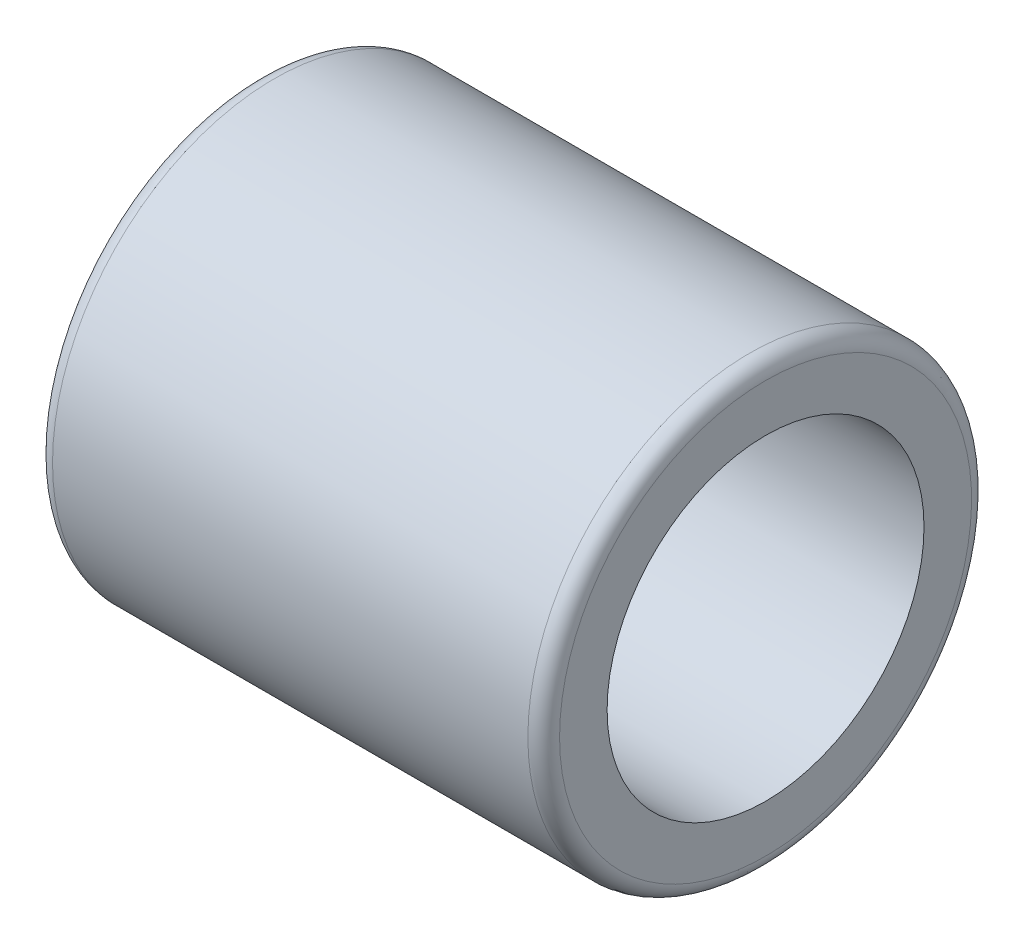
ISO-10303-21;
HEADER;
FILE_DESCRIPTION(('STEP AP214'),'2;1');
FILE_NAME('part.step','',(''),(''),'','','');
FILE_SCHEMA(('AUTOMOTIVE_DESIGN { 1 0 10303 214 1 1 1 1 }'));
ENDSEC;
DATA;
#1=APPLICATION_CONTEXT('core data for automotive mechanical design processes');
#2=APPLICATION_PROTOCOL_DEFINITION('international standard','automotive_design',2000,#1);
#3=PRODUCT_CONTEXT('',#1,'mechanical');
#4=PRODUCT('Part','Part','',(#3));
#5=PRODUCT_RELATED_PRODUCT_CATEGORY('part','',(#4));
#6=PRODUCT_DEFINITION_FORMATION('','',#4);
#7=PRODUCT_DEFINITION_CONTEXT('part definition',#1,'design');
#8=PRODUCT_DEFINITION('design','',#6,#7);
#9=PRODUCT_DEFINITION_SHAPE('','',#8);
#10=(LENGTH_UNIT() NAMED_UNIT(*) SI_UNIT(.MILLI.,.METRE.));
#11=(NAMED_UNIT(*) PLANE_ANGLE_UNIT() SI_UNIT($,.RADIAN.));
#12=(NAMED_UNIT(*) SI_UNIT($,.STERADIAN.) SOLID_ANGLE_UNIT());
#13=UNCERTAINTY_MEASURE_WITH_UNIT(LENGTH_MEASURE(1.E-05),#10,'distance_accuracy_value','');
#14=(GEOMETRIC_REPRESENTATION_CONTEXT(3) GLOBAL_UNCERTAINTY_ASSIGNED_CONTEXT((#13)) GLOBAL_UNIT_ASSIGNED_CONTEXT((#10,
#11,#12)) REPRESENTATION_CONTEXT('',''));
#15=CARTESIAN_POINT('',(0.,0.,0.));
#16=DIRECTION('',(0.,0.,1.));
#17=DIRECTION('',(1.,0.,0.));
#18=AXIS2_PLACEMENT_3D('',#15,#16,#17);
#19=CARTESIAN_POINT('',(0.,14.375,0.));
#20=DIRECTION('',(-1.,0.,0.));
#21=DIRECTION('',(0.,1.,0.));
#22=AXIS2_PLACEMENT_3D('',#19,#20,#21);
#23=PLANE('',#22);
#24=CARTESIAN_POINT('',(0.,0.,0.));
#25=DIRECTION('',(1.,0.,0.));
#26=DIRECTION('',(0.,1.,0.));
#27=AXIS2_PLACEMENT_3D('',#24,#25,#26);
#28=CIRCLE('',#27,12.5);
#29=CARTESIAN_POINT('',(0.,-12.5,0.));
#30=VERTEX_POINT('',#29);
#31=EDGE_CURVE('E103',#30,#30,#28,.T.);
#32=ORIENTED_EDGE('',*,*,#31,.T.);
#33=EDGE_LOOP('',(#32));
#34=FACE_BOUND('',#33,.T.);
#35=CARTESIAN_POINT('',(0.,0.,0.));
#36=DIRECTION('',(1.,0.,0.));
#37=DIRECTION('',(0.,1.,0.));
#38=AXIS2_PLACEMENT_3D('',#35,#36,#37);
#39=CIRCLE('',#38,16.25);
#40=CARTESIAN_POINT('',(0.,16.25,0.));
#41=VERTEX_POINT('',#40);
#42=CARTESIAN_POINT('',(0.,0.,16.25));
#43=VERTEX_POINT('',#42);
#44=EDGE_CURVE('E107',#41,#43,#39,.T.);
#45=ORIENTED_EDGE('',*,*,#44,.F.);
#46=CARTESIAN_POINT('',(0.,0.,0.));
#47=DIRECTION('',(1.,0.,0.));
#48=DIRECTION('',(0.,1.,0.));
#49=AXIS2_PLACEMENT_3D('',#46,#47,#48);
#50=CIRCLE('',#49,16.25);
#51=EDGE_CURVE('E97',#43,#41,#50,.T.);
#52=ORIENTED_EDGE('',*,*,#51,.F.);
#53=EDGE_LOOP('',(#45,#52));
#54=FACE_BOUND('',#53,.T.);
#55=ADVANCED_FACE('F16',(#34,#54),#23,.T.);
#56=CARTESIAN_POINT('',(40.,14.375,0.));
#57=DIRECTION('',(1.,0.,0.));
#58=DIRECTION('',(0.,1.,0.));
#59=AXIS2_PLACEMENT_3D('',#56,#57,#58);
#60=PLANE('',#59);
#61=CARTESIAN_POINT('',(40.,0.,0.));
#62=DIRECTION('',(1.,0.,0.));
#63=DIRECTION('',(0.,1.,0.));
#64=AXIS2_PLACEMENT_3D('',#61,#62,#63);
#65=CIRCLE('',#64,12.5);
#66=CARTESIAN_POINT('',(40.,-12.5,0.));
#67=VERTEX_POINT('',#66);
#68=EDGE_CURVE('E113',#67,#67,#65,.T.);
#69=ORIENTED_EDGE('',*,*,#68,.F.);
#70=EDGE_LOOP('',(#69));
#71=FACE_BOUND('',#70,.T.);
#72=CARTESIAN_POINT('',(40.,0.,0.));
#73=DIRECTION('',(1.,0.,0.));
#74=DIRECTION('',(0.,1.,0.));
#75=AXIS2_PLACEMENT_3D('',#72,#73,#74);
#76=CIRCLE('',#75,16.25);
#77=CARTESIAN_POINT('',(40.,16.25,0.));
#78=VERTEX_POINT('',#77);
#79=CARTESIAN_POINT('',(40.,0.,16.25));
#80=VERTEX_POINT('',#79);
#81=EDGE_CURVE('E98',#78,#80,#76,.T.);
#82=ORIENTED_EDGE('',*,*,#81,.T.);
#83=CARTESIAN_POINT('',(40.,0.,0.));
#84=DIRECTION('',(1.,0.,0.));
#85=DIRECTION('',(0.,1.,0.));
#86=AXIS2_PLACEMENT_3D('',#83,#84,#85);
#87=CIRCLE('',#86,16.25);
#88=EDGE_CURVE('E102',#80,#78,#87,.T.);
#89=ORIENTED_EDGE('',*,*,#88,.T.);
#90=EDGE_LOOP('',(#82,#89));
#91=FACE_BOUND('',#90,.T.);
#92=ADVANCED_FACE('F18',(#71,#91),#60,.T.);
#93=CARTESIAN_POINT('',(20.,0.,0.));
#94=DIRECTION('',(-1.,0.,0.));
#95=DIRECTION('',(0.,1.,0.));
#96=AXIS2_PLACEMENT_3D('',#93,#94,#95);
#97=CYLINDRICAL_SURFACE('',#96,17.5);
#98=CARTESIAN_POINT('',(1.25,0.,0.));
#99=DIRECTION('',(1.,0.,0.));
#100=DIRECTION('',(0.,1.,0.));
#101=AXIS2_PLACEMENT_3D('',#98,#99,#100);
#102=CIRCLE('',#101,17.5);
#103=CARTESIAN_POINT('',(1.25,-17.5,0.));
#104=VERTEX_POINT('',#103);
#105=CARTESIAN_POINT('',(1.25,0.,17.5));
#106=VERTEX_POINT('',#105);
#107=EDGE_CURVE('E77',#104,#106,#102,.T.);
#108=ORIENTED_EDGE('',*,*,#107,.T.);
#109=CARTESIAN_POINT('',(1.25,0.,0.));
#110=DIRECTION('',(1.,0.,0.));
#111=DIRECTION('',(0.,1.,0.));
#112=AXIS2_PLACEMENT_3D('',#109,#110,#111);
#113=CIRCLE('',#112,17.5);
#114=EDGE_CURVE('E79',#106,#104,#113,.T.);
#115=ORIENTED_EDGE('',*,*,#114,.T.);
#116=DIRECTION('',(1.,0.,0.));
#117=VECTOR('',#116,1.);
#118=CARTESIAN_POINT('',(20.,-17.5,0.));
#119=LINE('',#118,#117);
#120=CARTESIAN_POINT('',(38.75,-17.5,0.));
#121=VERTEX_POINT('',#120);
#122=EDGE_CURVE('E10',#104,#121,#119,.T.);
#123=ORIENTED_EDGE('',*,*,#122,.T.);
#124=CARTESIAN_POINT('',(38.75,0.,0.));
#125=DIRECTION('',(1.,0.,0.));
#126=DIRECTION('',(0.,1.,0.));
#127=AXIS2_PLACEMENT_3D('',#124,#125,#126);
#128=CIRCLE('',#127,17.5);
#129=CARTESIAN_POINT('',(38.75,0.,17.5));
#130=VERTEX_POINT('',#129);
#131=EDGE_CURVE('E94',#130,#121,#128,.T.);
#132=ORIENTED_EDGE('',*,*,#131,.F.);
#133=CARTESIAN_POINT('',(38.75,0.,0.));
#134=DIRECTION('',(1.,0.,0.));
#135=DIRECTION('',(0.,1.,0.));
#136=AXIS2_PLACEMENT_3D('',#133,#134,#135);
#137=CIRCLE('',#136,17.5);
#138=EDGE_CURVE('E25',#121,#130,#137,.T.);
#139=ORIENTED_EDGE('',*,*,#138,.F.);
#140=ORIENTED_EDGE('',*,*,#122,.F.);
#141=EDGE_LOOP('',(#108,#115,#123,#132,#139,#140));
#142=FACE_BOUND('',#141,.T.);
#143=ADVANCED_FACE('F75',(#142),#97,.T.);
#144=CARTESIAN_POINT('',(38.75,0.,0.));
#145=DIRECTION('',(1.,0.,0.));
#146=DIRECTION('',(0.,0.,-1.));
#147=AXIS2_PLACEMENT_3D('',#144,#145,#146);
#148=TOROIDAL_SURFACE('',#147,16.25,1.25);
#149=ORIENTED_EDGE('',*,*,#81,.F.);
#150=ORIENTED_EDGE('',*,*,#88,.F.);
#151=CARTESIAN_POINT('',(38.75,0.,16.25));
#152=DIRECTION('',(0.,-1.,0.));
#153=DIRECTION('',(0.,0.,1.));
#154=AXIS2_PLACEMENT_3D('',#151,#152,#153);
#155=CIRCLE('',#154,1.25);
#156=EDGE_CURVE('E122',#80,#130,#155,.T.);
#157=ORIENTED_EDGE('',*,*,#156,.T.);
#158=ORIENTED_EDGE('',*,*,#131,.T.);
#159=ORIENTED_EDGE('',*,*,#138,.T.);
#160=ORIENTED_EDGE('',*,*,#156,.F.);
#161=EDGE_LOOP('',(#149,#150,#157,#158,#159,#160));
#162=FACE_BOUND('',#161,.T.);
#163=ADVANCED_FACE('F129',(#162),#148,.T.);
#164=CARTESIAN_POINT('',(20.,0.,0.));
#165=DIRECTION('',(-1.,0.,0.));
#166=DIRECTION('',(0.,1.,0.));
#167=AXIS2_PLACEMENT_3D('',#164,#165,#166);
#168=CYLINDRICAL_SURFACE('',#167,12.5);
#169=ORIENTED_EDGE('',*,*,#68,.T.);
#170=DIRECTION('',(-1.,0.,0.));
#171=VECTOR('',#170,1.);
#172=CARTESIAN_POINT('',(20.,-12.5,0.));
#173=LINE('',#172,#171);
#174=EDGE_CURVE('E110',#67,#30,#173,.T.);
#175=ORIENTED_EDGE('',*,*,#174,.T.);
#176=ORIENTED_EDGE('',*,*,#31,.F.);
#177=ORIENTED_EDGE('',*,*,#174,.F.);
#178=EDGE_LOOP('',(#169,#175,#176,#177));
#179=FACE_BOUND('',#178,.T.);
#180=ADVANCED_FACE('F143',(#179),#168,.F.);
#181=CARTESIAN_POINT('',(1.25,0.,0.));
#182=DIRECTION('',(1.,0.,0.));
#183=DIRECTION('',(0.,0.,-1.));
#184=AXIS2_PLACEMENT_3D('',#181,#182,#183);
#185=TOROIDAL_SURFACE('',#184,16.25,1.25);
#186=ORIENTED_EDGE('',*,*,#107,.F.);
#187=ORIENTED_EDGE('',*,*,#114,.F.);
#188=CARTESIAN_POINT('',(1.25,0.,16.25));
#189=DIRECTION('',(0.,-1.,0.));
#190=DIRECTION('',(0.,0.,1.));
#191=AXIS2_PLACEMENT_3D('',#188,#189,#190);
#192=CIRCLE('',#191,1.25);
#193=EDGE_CURVE('E83',#106,#43,#192,.T.);
#194=ORIENTED_EDGE('',*,*,#193,.T.);
#195=ORIENTED_EDGE('',*,*,#51,.T.);
#196=ORIENTED_EDGE('',*,*,#44,.T.);
#197=ORIENTED_EDGE('',*,*,#193,.F.);
#198=EDGE_LOOP('',(#186,#187,#194,#195,#196,#197));
#199=FACE_BOUND('',#198,.T.);
#200=ADVANCED_FACE('F85',(#199),#185,.T.);
#201=CLOSED_SHELL('',(#55,#92,#143,#163,#180,#200));
#202=MANIFOLD_SOLID_BREP('B1',#201);
#203=ADVANCED_BREP_SHAPE_REPRESENTATION('',(#18,#202),#14);
#204=SHAPE_DEFINITION_REPRESENTATION(#9,#203);
ENDSEC;
END-ISO-10303-21;
